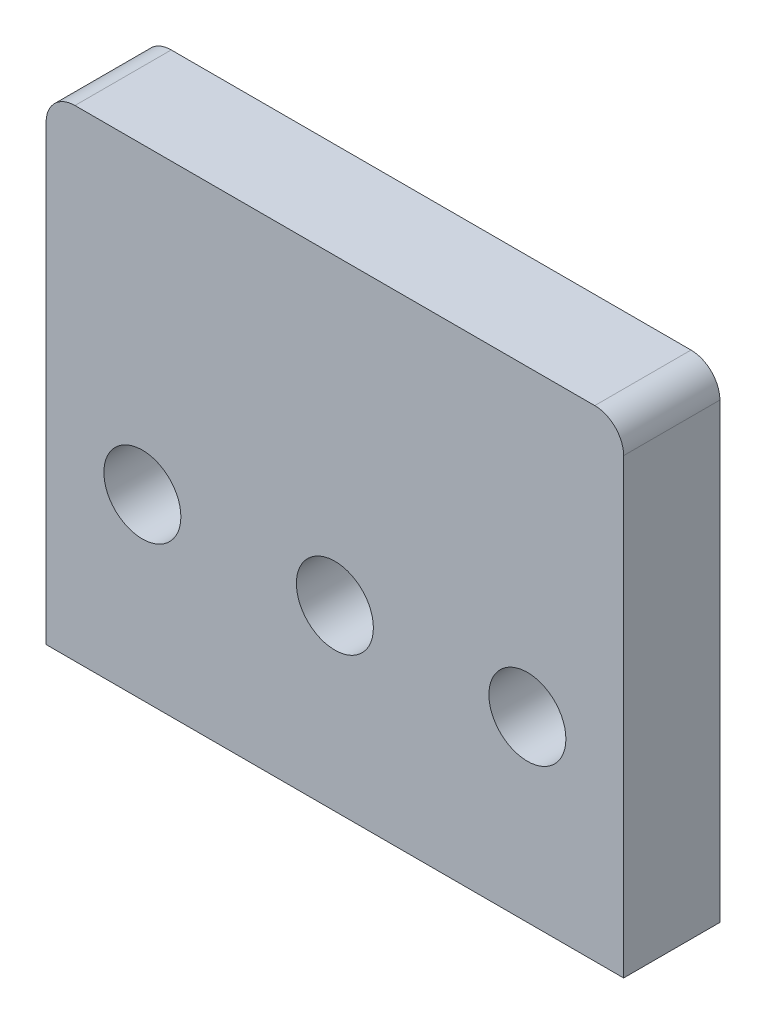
from build123d import *

# Parameters (mm, degrees)
ESQUISSE1_W             = 60
ESQUISSE1_H             = 50
BASE_EXTRUSION_DEPTH    = 10
CONG_1_R                = 3
ESQUISSE2_R             = 4
ENL_V_MAT_EXTRU_1_DEPTH = 10


with BuildPart() as part:
    # Esquisse1 → Base-Extrusion (new body)
    with BuildSketch(Plane.XY):
        with Locations((0, 6.5)):
            Rectangle(ESQUISSE1_W, ESQUISSE1_H)
    extrude(amount=BASE_EXTRUSION_DEPTH)

    # Cong_1
    cong_1_edges = [part.edges().sort_by_distance(p)[0] for p in [
        (30, 31.5, 5),
        (-30, 31.5, 5),
    ]]
    fillet(cong_1_edges, radius=CONG_1_R)

    # Esquisse2 → Enl_v. mat.-Extru.1 (cut)
    with BuildSketch(Plane.XY.offset(10)):
        with Locations((-20, 0)):
            Circle(ESQUISSE2_R)
        Circle(ESQUISSE2_R)
        with Locations((20, 0)):
            Circle(ESQUISSE2_R)
    extrude(amount=-ENL_V_MAT_EXTRU_1_DEPTH, mode=Mode.SUBTRACT)


solid = part.part
